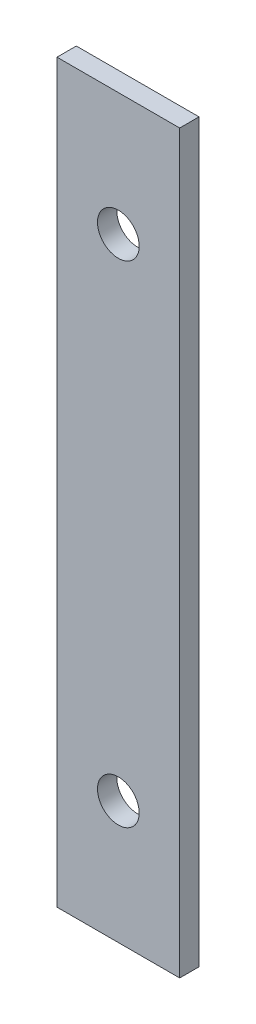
ISO-10303-21;
HEADER;
FILE_DESCRIPTION(('STEP AP214'),'2;1');
FILE_NAME('part.step','',(''),(''),'','','');
FILE_SCHEMA(('AUTOMOTIVE_DESIGN { 1 0 10303 214 1 1 1 1 }'));
ENDSEC;
DATA;
#1=APPLICATION_CONTEXT('core data for automotive mechanical design processes');
#2=APPLICATION_PROTOCOL_DEFINITION('international standard','automotive_design',2000,#1);
#3=PRODUCT_CONTEXT('',#1,'mechanical');
#4=PRODUCT('Part','Part','',(#3));
#5=PRODUCT_RELATED_PRODUCT_CATEGORY('part','',(#4));
#6=PRODUCT_DEFINITION_FORMATION('','',#4);
#7=PRODUCT_DEFINITION_CONTEXT('part definition',#1,'design');
#8=PRODUCT_DEFINITION('design','',#6,#7);
#9=PRODUCT_DEFINITION_SHAPE('','',#8);
#10=(LENGTH_UNIT() NAMED_UNIT(*) SI_UNIT(.MILLI.,.METRE.));
#11=(NAMED_UNIT(*) PLANE_ANGLE_UNIT() SI_UNIT($,.RADIAN.));
#12=(NAMED_UNIT(*) SI_UNIT($,.STERADIAN.) SOLID_ANGLE_UNIT());
#13=UNCERTAINTY_MEASURE_WITH_UNIT(LENGTH_MEASURE(1.E-05),#10,'distance_accuracy_value','');
#14=(GEOMETRIC_REPRESENTATION_CONTEXT(3) GLOBAL_UNCERTAINTY_ASSIGNED_CONTEXT((#13)) GLOBAL_UNIT_ASSIGNED_CONTEXT((#10,
#11,#12)) REPRESENTATION_CONTEXT('',''));
#15=CARTESIAN_POINT('',(0.,0.,0.));
#16=DIRECTION('',(0.,0.,1.));
#17=DIRECTION('',(1.,0.,0.));
#18=AXIS2_PLACEMENT_3D('',#15,#16,#17);
#19=CARTESIAN_POINT('',(5.,-30.,1.5748));
#20=DIRECTION('',(-1.,0.,0.));
#21=DIRECTION('',(0.,0.,1.));
#22=AXIS2_PLACEMENT_3D('',#19,#20,#21);
#23=PLANE('',#22);
#24=DIRECTION('',(0.,1.,0.));
#25=VECTOR('',#24,1.);
#26=CARTESIAN_POINT('',(5.,-30.,0.));
#27=LINE('',#26,#25);
#28=CARTESIAN_POINT('',(5.,-30.,0.));
#29=VERTEX_POINT('',#28);
#30=CARTESIAN_POINT('',(5.,30.,0.));
#31=VERTEX_POINT('',#30);
#32=EDGE_CURVE('E97',#29,#31,#27,.T.);
#33=ORIENTED_EDGE('',*,*,#32,.T.);
#34=DIRECTION('',(0.,0.,-1.));
#35=VECTOR('',#34,1.);
#36=CARTESIAN_POINT('',(5.,30.,1.5748));
#37=LINE('',#36,#35);
#38=CARTESIAN_POINT('',(5.,30.,1.5748));
#39=VERTEX_POINT('',#38);
#40=EDGE_CURVE('E11',#39,#31,#37,.T.);
#41=ORIENTED_EDGE('',*,*,#40,.F.);
#42=DIRECTION('',(0.,1.,0.));
#43=VECTOR('',#42,1.);
#44=CARTESIAN_POINT('',(5.,-30.,1.5748));
#45=LINE('',#44,#43);
#46=CARTESIAN_POINT('',(5.,-30.,1.5748));
#47=VERTEX_POINT('',#46);
#48=EDGE_CURVE('E85',#47,#39,#45,.T.);
#49=ORIENTED_EDGE('',*,*,#48,.F.);
#50=DIRECTION('',(0.,0.,-1.));
#51=VECTOR('',#50,1.);
#52=CARTESIAN_POINT('',(5.,-30.,1.5748));
#53=LINE('',#52,#51);
#54=EDGE_CURVE('E93',#47,#29,#53,.T.);
#55=ORIENTED_EDGE('',*,*,#54,.T.);
#56=EDGE_LOOP('',(#33,#41,#49,#55));
#57=FACE_BOUND('',#56,.T.);
#58=ADVANCED_FACE('F34',(#57),#23,.F.);
#59=CARTESIAN_POINT('',(-5.,30.,1.5748));
#60=DIRECTION('',(0.,-1.,0.));
#61=DIRECTION('',(0.,0.,-1.));
#62=AXIS2_PLACEMENT_3D('',#59,#60,#61);
#63=PLANE('',#62);
#64=DIRECTION('',(-1.,0.,0.));
#65=VECTOR('',#64,1.);
#66=CARTESIAN_POINT('',(-5.,30.,0.));
#67=LINE('',#66,#65);
#68=CARTESIAN_POINT('',(-5.,30.,0.));
#69=VERTEX_POINT('',#68);
#70=EDGE_CURVE('E89',#31,#69,#67,.T.);
#71=ORIENTED_EDGE('',*,*,#70,.T.);
#72=DIRECTION('',(0.,0.,-1.));
#73=VECTOR('',#72,1.);
#74=CARTESIAN_POINT('',(-5.,30.,1.5748));
#75=LINE('',#74,#73);
#76=CARTESIAN_POINT('',(-5.,30.,1.5748));
#77=VERTEX_POINT('',#76);
#78=EDGE_CURVE('E42',#77,#69,#75,.T.);
#79=ORIENTED_EDGE('',*,*,#78,.F.);
#80=DIRECTION('',(-1.,0.,0.));
#81=VECTOR('',#80,1.);
#82=CARTESIAN_POINT('',(-5.,30.,1.5748));
#83=LINE('',#82,#81);
#84=EDGE_CURVE('E80',#39,#77,#83,.T.);
#85=ORIENTED_EDGE('',*,*,#84,.F.);
#86=ORIENTED_EDGE('',*,*,#40,.T.);
#87=EDGE_LOOP('',(#71,#79,#85,#86));
#88=FACE_BOUND('',#87,.T.);
#89=ADVANCED_FACE('F88',(#88),#63,.F.);
#90=CARTESIAN_POINT('',(-5.,-30.,1.5748));
#91=DIRECTION('',(1.,0.,0.));
#92=DIRECTION('',(0.,0.,-1.));
#93=AXIS2_PLACEMENT_3D('',#90,#91,#92);
#94=PLANE('',#93);
#95=DIRECTION('',(0.,-1.,0.));
#96=VECTOR('',#95,1.);
#97=CARTESIAN_POINT('',(-5.,-30.,0.));
#98=LINE('',#97,#96);
#99=CARTESIAN_POINT('',(-5.,-30.,0.));
#100=VERTEX_POINT('',#99);
#101=EDGE_CURVE('E67',#69,#100,#98,.T.);
#102=ORIENTED_EDGE('',*,*,#101,.T.);
#103=DIRECTION('',(0.,0.,-1.));
#104=VECTOR('',#103,1.);
#105=CARTESIAN_POINT('',(-5.,-30.,1.5748));
#106=LINE('',#105,#104);
#107=CARTESIAN_POINT('',(-5.,-30.,1.5748));
#108=VERTEX_POINT('',#107);
#109=EDGE_CURVE('E90',#108,#100,#106,.T.);
#110=ORIENTED_EDGE('',*,*,#109,.F.);
#111=DIRECTION('',(0.,-1.,0.));
#112=VECTOR('',#111,1.);
#113=CARTESIAN_POINT('',(-5.,-30.,1.5748));
#114=LINE('',#113,#112);
#115=EDGE_CURVE('E83',#77,#108,#114,.T.);
#116=ORIENTED_EDGE('',*,*,#115,.F.);
#117=ORIENTED_EDGE('',*,*,#78,.T.);
#118=EDGE_LOOP('',(#102,#110,#116,#117));
#119=FACE_BOUND('',#118,.T.);
#120=ADVANCED_FACE('F91',(#119),#94,.F.);
#121=CARTESIAN_POINT('',(-5.,-30.,1.5748));
#122=DIRECTION('',(0.,1.,0.));
#123=DIRECTION('',(0.,0.,1.));
#124=AXIS2_PLACEMENT_3D('',#121,#122,#123);
#125=PLANE('',#124);
#126=DIRECTION('',(1.,0.,0.));
#127=VECTOR('',#126,1.);
#128=CARTESIAN_POINT('',(-5.,-30.,0.));
#129=LINE('',#128,#127);
#130=EDGE_CURVE('E73',#100,#29,#129,.T.);
#131=ORIENTED_EDGE('',*,*,#130,.T.);
#132=ORIENTED_EDGE('',*,*,#54,.F.);
#133=DIRECTION('',(1.,0.,0.));
#134=VECTOR('',#133,1.);
#135=CARTESIAN_POINT('',(-5.,-30.,1.5748));
#136=LINE('',#135,#134);
#137=EDGE_CURVE('E50',#108,#47,#136,.T.);
#138=ORIENTED_EDGE('',*,*,#137,.F.);
#139=ORIENTED_EDGE('',*,*,#109,.T.);
#140=EDGE_LOOP('',(#131,#132,#138,#139));
#141=FACE_BOUND('',#140,.T.);
#142=ADVANCED_FACE('F105',(#141),#125,.F.);
#143=CARTESIAN_POINT('',(0.,0.,1.5748));
#144=DIRECTION('',(0.,0.,-1.));
#145=DIRECTION('',(-1.,0.,0.));
#146=AXIS2_PLACEMENT_3D('',#143,#144,#145);
#147=PLANE('',#146);
#148=CARTESIAN_POINT('',(0.,20.,1.5748));
#149=DIRECTION('',(0.,0.,1.));
#150=DIRECTION('',(1.,0.,0.));
#151=AXIS2_PLACEMENT_3D('',#148,#149,#150);
#152=CIRCLE('',#151,1.69999999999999);
#153=CARTESIAN_POINT('',(1.69999999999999,20.,1.5748));
#154=VERTEX_POINT('',#153);
#155=EDGE_CURVE('E119',#154,#154,#152,.T.);
#156=ORIENTED_EDGE('',*,*,#155,.F.);
#157=EDGE_LOOP('',(#156));
#158=FACE_BOUND('',#157,.T.);
#159=CARTESIAN_POINT('',(0.,-20.,1.5748));
#160=DIRECTION('',(0.,0.,1.));
#161=DIRECTION('',(1.,0.,0.));
#162=AXIS2_PLACEMENT_3D('',#159,#160,#161);
#163=CIRCLE('',#162,1.69999999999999);
#164=CARTESIAN_POINT('',(1.69999999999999,-20.,1.5748));
#165=VERTEX_POINT('',#164);
#166=EDGE_CURVE('E113',#165,#165,#163,.T.);
#167=ORIENTED_EDGE('',*,*,#166,.F.);
#168=EDGE_LOOP('',(#167));
#169=FACE_BOUND('',#168,.T.);
#170=ORIENTED_EDGE('',*,*,#48,.T.);
#171=ORIENTED_EDGE('',*,*,#84,.T.);
#172=ORIENTED_EDGE('',*,*,#115,.T.);
#173=ORIENTED_EDGE('',*,*,#137,.T.);
#174=EDGE_LOOP('',(#170,#171,#172,#173));
#175=FACE_BOUND('',#174,.T.);
#176=ADVANCED_FACE('F81',(#158,#169,#175),#147,.F.);
#177=CARTESIAN_POINT('',(0.,0.,0.));
#178=DIRECTION('',(0.,0.,-1.));
#179=DIRECTION('',(-1.,0.,0.));
#180=AXIS2_PLACEMENT_3D('',#177,#178,#179);
#181=PLANE('',#180);
#182=CARTESIAN_POINT('',(0.,20.,0.));
#183=DIRECTION('',(0.,0.,1.));
#184=DIRECTION('',(1.,0.,0.));
#185=AXIS2_PLACEMENT_3D('',#182,#183,#184);
#186=CIRCLE('',#185,1.7);
#187=CARTESIAN_POINT('',(1.7,20.,0.));
#188=VERTEX_POINT('',#187);
#189=EDGE_CURVE('E116',#188,#188,#186,.T.);
#190=ORIENTED_EDGE('',*,*,#189,.T.);
#191=EDGE_LOOP('',(#190));
#192=FACE_BOUND('',#191,.T.);
#193=CARTESIAN_POINT('',(0.,-20.,0.));
#194=DIRECTION('',(0.,0.,1.));
#195=DIRECTION('',(1.,0.,0.));
#196=AXIS2_PLACEMENT_3D('',#193,#194,#195);
#197=CIRCLE('',#196,1.7);
#198=CARTESIAN_POINT('',(1.70000000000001,-20.,0.));
#199=VERTEX_POINT('',#198);
#200=EDGE_CURVE('E100',#199,#199,#197,.T.);
#201=ORIENTED_EDGE('',*,*,#200,.T.);
#202=EDGE_LOOP('',(#201));
#203=FACE_BOUND('',#202,.T.);
#204=ORIENTED_EDGE('',*,*,#32,.F.);
#205=ORIENTED_EDGE('',*,*,#130,.F.);
#206=ORIENTED_EDGE('',*,*,#101,.F.);
#207=ORIENTED_EDGE('',*,*,#70,.F.);
#208=EDGE_LOOP('',(#204,#205,#206,#207));
#209=FACE_BOUND('',#208,.T.);
#210=ADVANCED_FACE('F108',(#192,#203,#209),#181,.T.);
#211=CARTESIAN_POINT('',(0.,-20.,1.5748));
#212=DIRECTION('',(0.,0.,1.));
#213=DIRECTION('',(1.,0.,0.));
#214=AXIS2_PLACEMENT_3D('',#211,#212,#213);
#215=CYLINDRICAL_SURFACE('',#214,1.69999999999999);
#216=ORIENTED_EDGE('',*,*,#200,.F.);
#217=EDGE_LOOP('',(#216));
#218=FACE_BOUND('',#217,.T.);
#219=ORIENTED_EDGE('',*,*,#166,.T.);
#220=EDGE_LOOP('',(#219));
#221=FACE_BOUND('',#220,.T.);
#222=ADVANCED_FACE('F130',(#218,#221),#215,.F.);
#223=CARTESIAN_POINT('',(0.,20.,1.5748));
#224=DIRECTION('',(0.,0.,1.));
#225=DIRECTION('',(1.,0.,0.));
#226=AXIS2_PLACEMENT_3D('',#223,#224,#225);
#227=CYLINDRICAL_SURFACE('',#226,1.69999999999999);
#228=ORIENTED_EDGE('',*,*,#189,.F.);
#229=EDGE_LOOP('',(#228));
#230=FACE_BOUND('',#229,.T.);
#231=ORIENTED_EDGE('',*,*,#155,.T.);
#232=EDGE_LOOP('',(#231));
#233=FACE_BOUND('',#232,.T.);
#234=ADVANCED_FACE('F123',(#230,#233),#227,.F.);
#235=CLOSED_SHELL('',(#58,#89,#120,#142,#176,#210,#222,#234));
#236=MANIFOLD_SOLID_BREP('B2',#235);
#237=ADVANCED_BREP_SHAPE_REPRESENTATION('',(#18,#236),#14);
#238=SHAPE_DEFINITION_REPRESENTATION(#9,#237);
ENDSEC;
END-ISO-10303-21;
